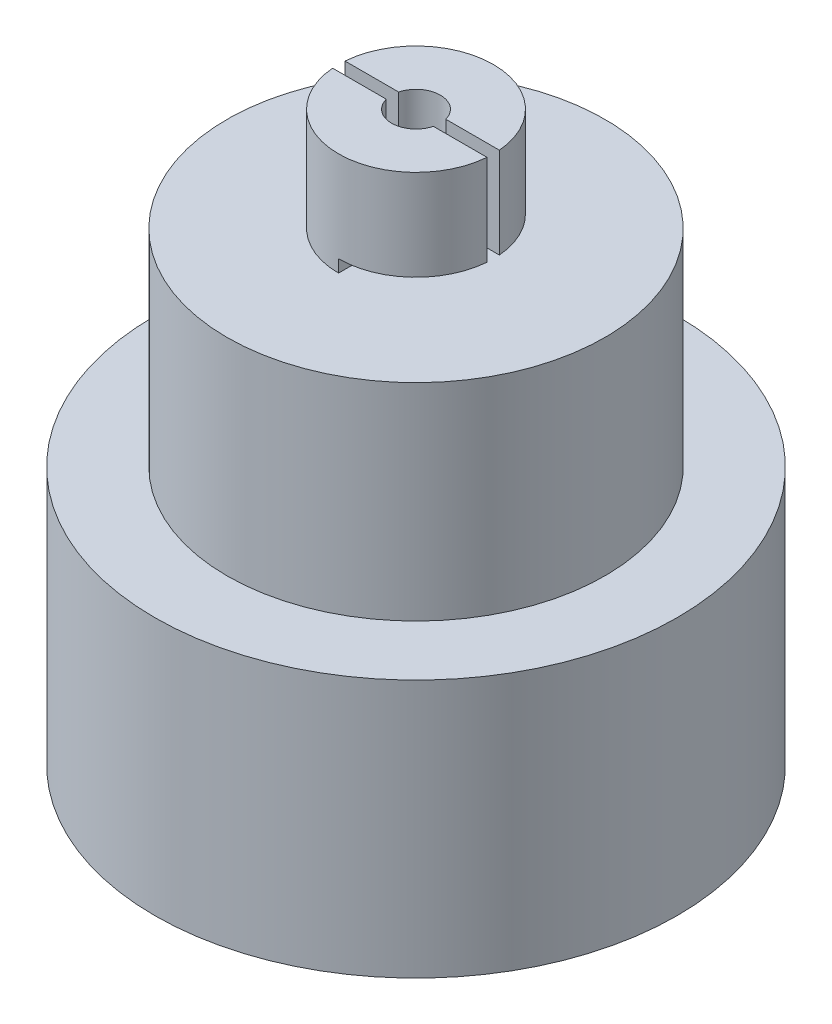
ISO-10303-21;
HEADER;
FILE_DESCRIPTION(('STEP AP214'),'2;1');
FILE_NAME('part.step','',(''),(''),'','','');
FILE_SCHEMA(('AUTOMOTIVE_DESIGN { 1 0 10303 214 1 1 1 1 }'));
ENDSEC;
DATA;
#1=APPLICATION_CONTEXT('core data for automotive mechanical design processes');
#2=APPLICATION_PROTOCOL_DEFINITION('international standard','automotive_design',2000,#1);
#3=PRODUCT_CONTEXT('',#1,'mechanical');
#4=PRODUCT('Part','Part','',(#3));
#5=PRODUCT_RELATED_PRODUCT_CATEGORY('part','',(#4));
#6=PRODUCT_DEFINITION_FORMATION('','',#4);
#7=PRODUCT_DEFINITION_CONTEXT('part definition',#1,'design');
#8=PRODUCT_DEFINITION('design','',#6,#7);
#9=PRODUCT_DEFINITION_SHAPE('','',#8);
#10=(LENGTH_UNIT() NAMED_UNIT(*) SI_UNIT(.MILLI.,.METRE.));
#11=(NAMED_UNIT(*) PLANE_ANGLE_UNIT() SI_UNIT($,.RADIAN.));
#12=(NAMED_UNIT(*) SI_UNIT($,.STERADIAN.) SOLID_ANGLE_UNIT());
#13=UNCERTAINTY_MEASURE_WITH_UNIT(LENGTH_MEASURE(1.E-05),#10,'distance_accuracy_value','');
#14=(GEOMETRIC_REPRESENTATION_CONTEXT(3) GLOBAL_UNCERTAINTY_ASSIGNED_CONTEXT((#13)) GLOBAL_UNIT_ASSIGNED_CONTEXT((#10,
#11,#12)) REPRESENTATION_CONTEXT('',''));
#15=CARTESIAN_POINT('',(0.,0.,0.));
#16=DIRECTION('',(0.,0.,1.));
#17=DIRECTION('',(1.,0.,0.));
#18=AXIS2_PLACEMENT_3D('',#15,#16,#17);
#19=CARTESIAN_POINT('',(0.,34.925,0.));
#20=DIRECTION('',(0.,-1.,0.));
#21=DIRECTION('',(0.,0.,-1.));
#22=AXIS2_PLACEMENT_3D('',#19,#20,#21);
#23=CYLINDRICAL_SURFACE('',#22,4.7625);
#24=DIRECTION('',(0.,-1.,0.));
#25=VECTOR('',#24,1.);
#26=CARTESIAN_POINT('',(0.,34.925,-4.7625));
#27=LINE('',#26,#25);
#28=CARTESIAN_POINT('',(0.,28.575,-4.7625));
#29=VERTEX_POINT('',#28);
#30=CARTESIAN_POINT('',(0.,29.337,-4.7625));
#31=VERTEX_POINT('',#30);
#32=EDGE_CURVE('E127',#29,#31,#27,.F.);
#33=ORIENTED_EDGE('',*,*,#32,.F.);
#34=CARTESIAN_POINT('',(0.,28.575,0.));
#35=DIRECTION('',(0.,1.,0.));
#36=DIRECTION('',(0.,0.,1.));
#37=AXIS2_PLACEMENT_3D('',#34,#35,#36);
#38=CIRCLE('',#37,4.7625);
#39=CARTESIAN_POINT('',(-4.74723553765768,28.575,-0.381));
#40=VERTEX_POINT('',#39);
#41=EDGE_CURVE('E137',#29,#40,#38,.T.);
#42=ORIENTED_EDGE('',*,*,#41,.T.);
#43=DIRECTION('',(0.,-1.,0.));
#44=VECTOR('',#43,1.);
#45=CARTESIAN_POINT('',(-4.74723553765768,34.925,-0.381));
#46=LINE('',#45,#44);
#47=CARTESIAN_POINT('',(-4.74723553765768,34.925,-0.381));
#48=VERTEX_POINT('',#47);
#49=EDGE_CURVE('E162',#48,#40,#46,.T.);
#50=ORIENTED_EDGE('',*,*,#49,.F.);
#51=CARTESIAN_POINT('',(0.,34.925,0.));
#52=DIRECTION('',(0.,1.,0.));
#53=DIRECTION('',(0.,0.,1.));
#54=AXIS2_PLACEMENT_3D('',#51,#52,#53);
#55=CIRCLE('',#54,4.7625);
#56=CARTESIAN_POINT('',(4.74723553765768,34.925,-0.381));
#57=VERTEX_POINT('',#56);
#58=EDGE_CURVE('E151',#57,#48,#55,.T.);
#59=ORIENTED_EDGE('',*,*,#58,.F.);
#60=DIRECTION('',(0.,-1.,0.));
#61=VECTOR('',#60,1.);
#62=CARTESIAN_POINT('',(4.74723553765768,34.925,-0.381));
#63=LINE('',#62,#61);
#64=CARTESIAN_POINT('',(4.74723553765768,29.337,-0.381));
#65=VERTEX_POINT('',#64);
#66=EDGE_CURVE('E160',#57,#65,#63,.T.);
#67=ORIENTED_EDGE('',*,*,#66,.T.);
#68=CARTESIAN_POINT('',(0.,29.337,0.));
#69=DIRECTION('',(0.,1.,0.));
#70=DIRECTION('',(0.,0.,1.));
#71=AXIS2_PLACEMENT_3D('',#68,#69,#70);
#72=CIRCLE('',#71,4.7625);
#73=EDGE_CURVE('E140',#65,#31,#72,.T.);
#74=ORIENTED_EDGE('',*,*,#73,.T.);
#75=EDGE_LOOP('',(#33,#42,#50,#59,#67,#74));
#76=FACE_BOUND('',#75,.T.);
#77=ADVANCED_FACE('F34',(#76),#23,.T.);
#78=CARTESIAN_POINT('',(0.,34.925,0.));
#79=DIRECTION('',(0.,-1.,0.));
#80=DIRECTION('',(0.,0.,-1.));
#81=AXIS2_PLACEMENT_3D('',#78,#79,#80);
#82=CYLINDRICAL_SURFACE('',#81,4.7625);
#83=DIRECTION('',(0.,-1.,0.));
#84=VECTOR('',#83,1.);
#85=CARTESIAN_POINT('',(0.,34.925,4.7625));
#86=LINE('',#85,#84);
#87=CARTESIAN_POINT('',(0.,29.337,4.7625));
#88=VERTEX_POINT('',#87);
#89=CARTESIAN_POINT('',(0.,28.575,4.7625));
#90=VERTEX_POINT('',#89);
#91=EDGE_CURVE('E142',#88,#90,#86,.T.);
#92=ORIENTED_EDGE('',*,*,#91,.F.);
#93=CARTESIAN_POINT('',(0.,29.337,0.));
#94=DIRECTION('',(0.,1.,0.));
#95=DIRECTION('',(0.,0.,1.));
#96=AXIS2_PLACEMENT_3D('',#93,#94,#95);
#97=CIRCLE('',#96,4.7625);
#98=CARTESIAN_POINT('',(4.74723553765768,29.337,0.381));
#99=VERTEX_POINT('',#98);
#100=EDGE_CURVE('E260',#88,#99,#97,.T.);
#101=ORIENTED_EDGE('',*,*,#100,.T.);
#102=DIRECTION('',(0.,-1.,0.));
#103=VECTOR('',#102,1.);
#104=CARTESIAN_POINT('',(4.74723553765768,34.925,0.381));
#105=LINE('',#104,#103);
#106=CARTESIAN_POINT('',(4.74723553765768,34.925,0.381));
#107=VERTEX_POINT('',#106);
#108=EDGE_CURVE('E149',#107,#99,#105,.T.);
#109=ORIENTED_EDGE('',*,*,#108,.F.);
#110=CARTESIAN_POINT('',(0.,34.925,0.));
#111=DIRECTION('',(0.,1.,0.));
#112=DIRECTION('',(0.,0.,1.));
#113=AXIS2_PLACEMENT_3D('',#110,#111,#112);
#114=CIRCLE('',#113,4.7625);
#115=CARTESIAN_POINT('',(-4.74723553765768,34.925,0.381));
#116=VERTEX_POINT('',#115);
#117=EDGE_CURVE('E200',#116,#107,#114,.T.);
#118=ORIENTED_EDGE('',*,*,#117,.F.);
#119=DIRECTION('',(0.,-1.,0.));
#120=VECTOR('',#119,1.);
#121=CARTESIAN_POINT('',(-4.74723553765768,34.925,0.381));
#122=LINE('',#121,#120);
#123=CARTESIAN_POINT('',(-4.74723553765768,28.575,0.381));
#124=VERTEX_POINT('',#123);
#125=EDGE_CURVE('E154',#116,#124,#122,.T.);
#126=ORIENTED_EDGE('',*,*,#125,.T.);
#127=CARTESIAN_POINT('',(0.,28.575,0.));
#128=DIRECTION('',(0.,1.,0.));
#129=DIRECTION('',(0.,0.,1.));
#130=AXIS2_PLACEMENT_3D('',#127,#128,#129);
#131=CIRCLE('',#130,4.7625);
#132=EDGE_CURVE('E194',#124,#90,#131,.T.);
#133=ORIENTED_EDGE('',*,*,#132,.T.);
#134=EDGE_LOOP('',(#92,#101,#109,#118,#126,#133));
#135=FACE_BOUND('',#134,.T.);
#136=ADVANCED_FACE('F244',(#135),#82,.T.);
#137=CARTESIAN_POINT('',(0.,28.575,0.));
#138=DIRECTION('',(0.,1.,0.));
#139=DIRECTION('',(0.,0.,1.));
#140=AXIS2_PLACEMENT_3D('',#137,#138,#139);
#141=CYLINDRICAL_SURFACE('',#140,1.4986);
#142=DIRECTION('',(0.,1.,0.));
#143=VECTOR('',#142,1.);
#144=CARTESIAN_POINT('',(0.,28.575,1.4986));
#145=LINE('',#144,#143);
#146=CARTESIAN_POINT('',(0.,28.575,1.4986));
#147=VERTEX_POINT('',#146);
#148=CARTESIAN_POINT('',(0.,29.337,1.4986));
#149=VERTEX_POINT('',#148);
#150=EDGE_CURVE('E262',#147,#149,#145,.T.);
#151=ORIENTED_EDGE('',*,*,#150,.F.);
#152=CARTESIAN_POINT('',(0.,28.575,0.));
#153=DIRECTION('',(0.,1.,0.));
#154=DIRECTION('',(0.,0.,1.));
#155=AXIS2_PLACEMENT_3D('',#152,#153,#154);
#156=CIRCLE('',#155,1.4986);
#157=CARTESIAN_POINT('',(-1.44935880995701,28.575,0.381));
#158=VERTEX_POINT('',#157);
#159=EDGE_CURVE('E222',#158,#147,#156,.T.);
#160=ORIENTED_EDGE('',*,*,#159,.F.);
#161=DIRECTION('',(0.,1.,0.));
#162=VECTOR('',#161,1.);
#163=CARTESIAN_POINT('',(-1.44935880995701,28.575,0.381));
#164=LINE('',#163,#162);
#165=CARTESIAN_POINT('',(-1.44935880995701,34.925,0.381));
#166=VERTEX_POINT('',#165);
#167=EDGE_CURVE('E196',#166,#158,#164,.F.);
#168=ORIENTED_EDGE('',*,*,#167,.F.);
#169=CARTESIAN_POINT('',(0.,34.925,0.));
#170=DIRECTION('',(0.,1.,0.));
#171=DIRECTION('',(0.,0.,1.));
#172=AXIS2_PLACEMENT_3D('',#169,#170,#171);
#173=CIRCLE('',#172,1.4986);
#174=CARTESIAN_POINT('',(1.44935880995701,34.925,0.381));
#175=VERTEX_POINT('',#174);
#176=EDGE_CURVE('E176',#166,#175,#173,.T.);
#177=ORIENTED_EDGE('',*,*,#176,.T.);
#178=DIRECTION('',(0.,1.,0.));
#179=VECTOR('',#178,1.);
#180=CARTESIAN_POINT('',(1.44935880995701,28.575,0.381));
#181=LINE('',#180,#179);
#182=CARTESIAN_POINT('',(1.44935880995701,29.337,0.381));
#183=VERTEX_POINT('',#182);
#184=EDGE_CURVE('E191',#183,#175,#181,.T.);
#185=ORIENTED_EDGE('',*,*,#184,.F.);
#186=CARTESIAN_POINT('',(0.,29.337,0.));
#187=DIRECTION('',(0.,1.,0.));
#188=DIRECTION('',(0.,0.,1.));
#189=AXIS2_PLACEMENT_3D('',#186,#187,#188);
#190=CIRCLE('',#189,1.4986);
#191=EDGE_CURVE('E254',#183,#149,#190,.F.);
#192=ORIENTED_EDGE('',*,*,#191,.T.);
#193=EDGE_LOOP('',(#151,#160,#168,#177,#185,#192));
#194=FACE_BOUND('',#193,.T.);
#195=ADVANCED_FACE('F252',(#194),#141,.F.);
#196=DIRECTION('',(0.,1.,0.));
#197=VECTOR('',#196,1.);
#198=CARTESIAN_POINT('',(0.,28.575,-1.4986));
#199=LINE('',#198,#197);
#200=CARTESIAN_POINT('',(0.,29.337,-1.4986));
#201=VERTEX_POINT('',#200);
#202=CARTESIAN_POINT('',(0.,28.575,-1.4986));
#203=VERTEX_POINT('',#202);
#204=EDGE_CURVE('E11',#201,#203,#199,.F.);
#205=ORIENTED_EDGE('',*,*,#204,.F.);
#206=CARTESIAN_POINT('',(0.,29.337,0.));
#207=DIRECTION('',(0.,1.,0.));
#208=DIRECTION('',(0.,0.,1.));
#209=AXIS2_PLACEMENT_3D('',#206,#207,#208);
#210=CIRCLE('',#209,1.4986);
#211=CARTESIAN_POINT('',(1.44935880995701,29.337,-0.381));
#212=VERTEX_POINT('',#211);
#213=EDGE_CURVE('E42',#201,#212,#210,.F.);
#214=ORIENTED_EDGE('',*,*,#213,.T.);
#215=DIRECTION('',(0.,1.,0.));
#216=VECTOR('',#215,1.);
#217=CARTESIAN_POINT('',(1.44935880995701,28.575,-0.381));
#218=LINE('',#217,#216);
#219=CARTESIAN_POINT('',(1.44935880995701,34.925,-0.381));
#220=VERTEX_POINT('',#219);
#221=EDGE_CURVE('E56',#220,#212,#218,.F.);
#222=ORIENTED_EDGE('',*,*,#221,.F.);
#223=CARTESIAN_POINT('',(0.,34.925,0.));
#224=DIRECTION('',(0.,1.,0.));
#225=DIRECTION('',(0.,0.,1.));
#226=AXIS2_PLACEMENT_3D('',#223,#224,#225);
#227=CIRCLE('',#226,1.4986);
#228=CARTESIAN_POINT('',(-1.44935880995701,34.925,-0.381));
#229=VERTEX_POINT('',#228);
#230=EDGE_CURVE('E217',#220,#229,#227,.T.);
#231=ORIENTED_EDGE('',*,*,#230,.T.);
#232=DIRECTION('',(0.,1.,0.));
#233=VECTOR('',#232,1.);
#234=CARTESIAN_POINT('',(-1.44935880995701,28.575,-0.381));
#235=LINE('',#234,#233);
#236=CARTESIAN_POINT('',(-1.44935880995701,28.575,-0.381));
#237=VERTEX_POINT('',#236);
#238=EDGE_CURVE('E190',#237,#229,#235,.T.);
#239=ORIENTED_EDGE('',*,*,#238,.F.);
#240=EDGE_CURVE('E221',#203,#237,#156,.T.);
#241=ORIENTED_EDGE('',*,*,#240,.F.);
#242=EDGE_LOOP('',(#205,#214,#222,#231,#239,#241));
#243=FACE_BOUND('',#242,.T.);
#244=ADVANCED_FACE('F181',(#243),#141,.F.);
#245=CARTESIAN_POINT('',(4.74723553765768,34.925,-0.381));
#246=DIRECTION('',(0.,0.,-1.));
#247=DIRECTION('',(-1.,0.,0.));
#248=AXIS2_PLACEMENT_3D('',#245,#246,#247);
#249=PLANE('',#248);
#250=DIRECTION('',(1.,0.,0.));
#251=VECTOR('',#250,1.);
#252=CARTESIAN_POINT('',(4.74723553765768,28.575,-0.381));
#253=LINE('',#252,#251);
#254=EDGE_CURVE('E148',#40,#237,#253,.T.);
#255=ORIENTED_EDGE('',*,*,#254,.T.);
#256=ORIENTED_EDGE('',*,*,#238,.T.);
#257=DIRECTION('',(1.,0.,0.));
#258=VECTOR('',#257,1.);
#259=CARTESIAN_POINT('',(4.74723553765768,34.925,-0.381));
#260=LINE('',#259,#258);
#261=EDGE_CURVE('E157',#48,#229,#260,.T.);
#262=ORIENTED_EDGE('',*,*,#261,.F.);
#263=ORIENTED_EDGE('',*,*,#49,.T.);
#264=EDGE_LOOP('',(#255,#256,#262,#263));
#265=FACE_BOUND('',#264,.T.);
#266=ADVANCED_FACE('F219',(#265),#249,.F.);
#267=CARTESIAN_POINT('',(4.74723553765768,34.925,0.381));
#268=DIRECTION('',(0.,0.,1.));
#269=DIRECTION('',(1.,0.,0.));
#270=AXIS2_PLACEMENT_3D('',#267,#268,#269);
#271=PLANE('',#270);
#272=ORIENTED_EDGE('',*,*,#108,.T.);
#273=DIRECTION('',(-1.,0.,0.));
#274=VECTOR('',#273,1.);
#275=CARTESIAN_POINT('',(4.74723553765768,29.337,0.381));
#276=LINE('',#275,#274);
#277=EDGE_CURVE('E258',#99,#183,#276,.T.);
#278=ORIENTED_EDGE('',*,*,#277,.T.);
#279=ORIENTED_EDGE('',*,*,#184,.T.);
#280=DIRECTION('',(-1.,0.,0.));
#281=VECTOR('',#280,1.);
#282=CARTESIAN_POINT('',(4.74723553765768,34.925,0.381));
#283=LINE('',#282,#281);
#284=EDGE_CURVE('E205',#107,#175,#283,.T.);
#285=ORIENTED_EDGE('',*,*,#284,.F.);
#286=EDGE_LOOP('',(#272,#278,#279,#285));
#287=FACE_BOUND('',#286,.T.);
#288=ADVANCED_FACE('F257',(#287),#271,.F.);
#289=CARTESIAN_POINT('',(0.,28.575,0.));
#290=DIRECTION('',(0.,1.,0.));
#291=DIRECTION('',(0.,0.,1.));
#292=AXIS2_PLACEMENT_3D('',#289,#290,#291);
#293=PLANE('',#292);
#294=DIRECTION('',(0.,0.,1.));
#295=VECTOR('',#294,1.);
#296=CARTESIAN_POINT('',(0.,28.575,-7.4811346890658));
#297=LINE('',#296,#295);
#298=EDGE_CURVE('E132',#147,#90,#297,.T.);
#299=ORIENTED_EDGE('',*,*,#298,.T.);
#300=ORIENTED_EDGE('',*,*,#132,.F.);
#301=DIRECTION('',(-1.,0.,0.));
#302=VECTOR('',#301,1.);
#303=CARTESIAN_POINT('',(4.74723553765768,28.575,0.381));
#304=LINE('',#303,#302);
#305=EDGE_CURVE('E204',#158,#124,#304,.T.);
#306=ORIENTED_EDGE('',*,*,#305,.F.);
#307=ORIENTED_EDGE('',*,*,#159,.T.);
#308=EDGE_LOOP('',(#299,#300,#306,#307));
#309=FACE_BOUND('',#308,.T.);
#310=EDGE_CURVE('E49',#29,#203,#297,.T.);
#311=ORIENTED_EDGE('',*,*,#310,.T.);
#312=ORIENTED_EDGE('',*,*,#240,.T.);
#313=ORIENTED_EDGE('',*,*,#254,.F.);
#314=ORIENTED_EDGE('',*,*,#41,.F.);
#315=EDGE_LOOP('',(#311,#312,#313,#314));
#316=FACE_BOUND('',#315,.T.);
#317=CARTESIAN_POINT('',(0.,28.575,0.));
#318=DIRECTION('',(0.,1.,0.));
#319=DIRECTION('',(0.,0.,1.));
#320=AXIS2_PLACEMENT_3D('',#317,#318,#319);
#321=CIRCLE('',#320,11.6205);
#322=CARTESIAN_POINT('',(0.,28.575,11.6205));
#323=VERTEX_POINT('',#322);
#324=EDGE_CURVE('E167',#323,#323,#321,.T.);
#325=ORIENTED_EDGE('',*,*,#324,.T.);
#326=EDGE_LOOP('',(#325));
#327=FACE_BOUND('',#326,.T.);
#328=ADVANCED_FACE('F145',(#309,#316,#327),#293,.T.);
#329=CARTESIAN_POINT('',(0.,15.875,0.));
#330=DIRECTION('',(0.,1.,0.));
#331=DIRECTION('',(0.,0.,1.));
#332=AXIS2_PLACEMENT_3D('',#329,#330,#331);
#333=PLANE('',#332);
#334=CARTESIAN_POINT('',(0.,15.875,0.));
#335=DIRECTION('',(0.,1.,0.));
#336=DIRECTION('',(0.,0.,1.));
#337=AXIS2_PLACEMENT_3D('',#334,#335,#336);
#338=CIRCLE('',#337,16.0655);
#339=CARTESIAN_POINT('',(0.,15.875,16.0655));
#340=VERTEX_POINT('',#339);
#341=EDGE_CURVE('E173',#340,#340,#338,.T.);
#342=ORIENTED_EDGE('',*,*,#341,.T.);
#343=EDGE_LOOP('',(#342));
#344=FACE_BOUND('',#343,.T.);
#345=CARTESIAN_POINT('',(0.,15.875,0.));
#346=DIRECTION('',(0.,1.,0.));
#347=DIRECTION('',(0.,0.,1.));
#348=AXIS2_PLACEMENT_3D('',#345,#346,#347);
#349=CIRCLE('',#348,11.6205);
#350=CARTESIAN_POINT('',(0.,15.875,11.6205));
#351=VERTEX_POINT('',#350);
#352=EDGE_CURVE('E164',#351,#351,#349,.T.);
#353=ORIENTED_EDGE('',*,*,#352,.F.);
#354=EDGE_LOOP('',(#353));
#355=FACE_BOUND('',#354,.T.);
#356=ADVANCED_FACE('F286',(#344,#355),#333,.T.);
#357=CARTESIAN_POINT('',(0.,15.875,0.));
#358=DIRECTION('',(0.,-1.,0.));
#359=DIRECTION('',(0.,0.,-1.));
#360=AXIS2_PLACEMENT_3D('',#357,#358,#359);
#361=CYLINDRICAL_SURFACE('',#360,16.0655);
#362=ORIENTED_EDGE('',*,*,#341,.F.);
#363=EDGE_LOOP('',(#362));
#364=FACE_BOUND('',#363,.T.);
#365=CARTESIAN_POINT('',(0.,0.,0.));
#366=DIRECTION('',(0.,1.,0.));
#367=DIRECTION('',(0.,0.,1.));
#368=AXIS2_PLACEMENT_3D('',#365,#366,#367);
#369=CIRCLE('',#368,16.0655);
#370=CARTESIAN_POINT('',(0.,0.,16.0655));
#371=VERTEX_POINT('',#370);
#372=EDGE_CURVE('E170',#371,#371,#369,.T.);
#373=ORIENTED_EDGE('',*,*,#372,.T.);
#374=EDGE_LOOP('',(#373));
#375=FACE_BOUND('',#374,.T.);
#376=ADVANCED_FACE('F36',(#364,#375),#361,.T.);
#377=CARTESIAN_POINT('',(0.,0.,0.));
#378=DIRECTION('',(0.,1.,0.));
#379=DIRECTION('',(0.,0.,1.));
#380=AXIS2_PLACEMENT_3D('',#377,#378,#379);
#381=PLANE('',#380);
#382=CARTESIAN_POINT('',(0.,0.,0.));
#383=DIRECTION('',(0.,-1.,0.));
#384=DIRECTION('',(0.,0.,-1.));
#385=AXIS2_PLACEMENT_3D('',#382,#383,#384);
#386=CIRCLE('',#385,12.446);
#387=CARTESIAN_POINT('',(0.,0.,-12.446));
#388=VERTEX_POINT('',#387);
#389=EDGE_CURVE('E228',#388,#388,#386,.T.);
#390=ORIENTED_EDGE('',*,*,#389,.F.);
#391=EDGE_LOOP('',(#390));
#392=FACE_BOUND('',#391,.T.);
#393=ORIENTED_EDGE('',*,*,#372,.F.);
#394=EDGE_LOOP('',(#393));
#395=FACE_BOUND('',#394,.T.);
#396=ADVANCED_FACE('F278',(#392,#395),#381,.F.);
#397=CARTESIAN_POINT('',(0.,28.575,0.));
#398=DIRECTION('',(0.,-1.,0.));
#399=DIRECTION('',(0.,0.,-1.));
#400=AXIS2_PLACEMENT_3D('',#397,#398,#399);
#401=CYLINDRICAL_SURFACE('',#400,11.6205);
#402=ORIENTED_EDGE('',*,*,#324,.F.);
#403=EDGE_LOOP('',(#402));
#404=FACE_BOUND('',#403,.T.);
#405=ORIENTED_EDGE('',*,*,#352,.T.);
#406=EDGE_LOOP('',(#405));
#407=FACE_BOUND('',#406,.T.);
#408=ADVANCED_FACE('F281',(#404,#407),#401,.T.);
#409=ORIENTED_EDGE('',*,*,#221,.T.);
#410=DIRECTION('',(1.,0.,0.));
#411=VECTOR('',#410,1.);
#412=CARTESIAN_POINT('',(4.74723553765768,29.337,-0.381));
#413=LINE('',#412,#411);
#414=EDGE_CURVE('E188',#212,#65,#413,.T.);
#415=ORIENTED_EDGE('',*,*,#414,.T.);
#416=ORIENTED_EDGE('',*,*,#66,.F.);
#417=EDGE_CURVE('E189',#220,#57,#260,.T.);
#418=ORIENTED_EDGE('',*,*,#417,.F.);
#419=EDGE_LOOP('',(#409,#415,#416,#418));
#420=FACE_BOUND('',#419,.T.);
#421=ADVANCED_FACE('F186',(#420),#249,.F.);
#422=CARTESIAN_POINT('',(0.,34.925,0.));
#423=DIRECTION('',(0.,1.,0.));
#424=DIRECTION('',(0.,0.,1.));
#425=AXIS2_PLACEMENT_3D('',#422,#423,#424);
#426=PLANE('',#425);
#427=ORIENTED_EDGE('',*,*,#230,.F.);
#428=ORIENTED_EDGE('',*,*,#417,.T.);
#429=ORIENTED_EDGE('',*,*,#58,.T.);
#430=ORIENTED_EDGE('',*,*,#261,.T.);
#431=EDGE_LOOP('',(#427,#428,#429,#430));
#432=FACE_BOUND('',#431,.T.);
#433=ADVANCED_FACE('F216',(#432),#426,.T.);
#434=EDGE_CURVE('E203',#166,#116,#283,.T.);
#435=ORIENTED_EDGE('',*,*,#434,.F.);
#436=ORIENTED_EDGE('',*,*,#167,.T.);
#437=ORIENTED_EDGE('',*,*,#305,.T.);
#438=ORIENTED_EDGE('',*,*,#125,.F.);
#439=EDGE_LOOP('',(#435,#436,#437,#438));
#440=FACE_BOUND('',#439,.T.);
#441=ADVANCED_FACE('F235',(#440),#271,.F.);
#442=CARTESIAN_POINT('',(0.,34.925,0.));
#443=DIRECTION('',(0.,1.,0.));
#444=DIRECTION('',(0.,0.,1.));
#445=AXIS2_PLACEMENT_3D('',#442,#443,#444);
#446=PLANE('',#445);
#447=ORIENTED_EDGE('',*,*,#176,.F.);
#448=ORIENTED_EDGE('',*,*,#434,.T.);
#449=ORIENTED_EDGE('',*,*,#117,.T.);
#450=ORIENTED_EDGE('',*,*,#284,.T.);
#451=EDGE_LOOP('',(#447,#448,#449,#450));
#452=FACE_BOUND('',#451,.T.);
#453=ADVANCED_FACE('F249',(#452),#446,.T.);
#454=CARTESIAN_POINT('',(0.,12.7,0.));
#455=DIRECTION('',(0.,-1.,0.));
#456=DIRECTION('',(0.,0.,-1.));
#457=AXIS2_PLACEMENT_3D('',#454,#455,#456);
#458=CYLINDRICAL_SURFACE('',#457,12.446);
#459=CARTESIAN_POINT('',(0.,12.7,0.));
#460=DIRECTION('',(0.,-1.,0.));
#461=DIRECTION('',(0.,0.,-1.));
#462=AXIS2_PLACEMENT_3D('',#459,#460,#461);
#463=CIRCLE('',#462,12.446);
#464=CARTESIAN_POINT('',(0.,12.7,-12.446));
#465=VERTEX_POINT('',#464);
#466=EDGE_CURVE('E223',#465,#465,#463,.T.);
#467=ORIENTED_EDGE('',*,*,#466,.F.);
#468=EDGE_LOOP('',(#467));
#469=FACE_BOUND('',#468,.T.);
#470=ORIENTED_EDGE('',*,*,#389,.T.);
#471=EDGE_LOOP('',(#470));
#472=FACE_BOUND('',#471,.T.);
#473=ADVANCED_FACE('F276',(#469,#472),#458,.F.);
#474=CARTESIAN_POINT('',(0.,12.7,0.));
#475=DIRECTION('',(0.,-1.,0.));
#476=DIRECTION('',(0.,0.,-1.));
#477=AXIS2_PLACEMENT_3D('',#474,#475,#476);
#478=PLANE('',#477);
#479=CARTESIAN_POINT('',(0.,12.7,0.));
#480=DIRECTION('',(0.,-1.,0.));
#481=DIRECTION('',(0.,0.,-1.));
#482=AXIS2_PLACEMENT_3D('',#479,#480,#481);
#483=CIRCLE('',#482,7.62);
#484=CARTESIAN_POINT('',(0.,12.7,-7.62));
#485=VERTEX_POINT('',#484);
#486=EDGE_CURVE('E141',#485,#485,#483,.T.);
#487=ORIENTED_EDGE('',*,*,#486,.F.);
#488=EDGE_LOOP('',(#487));
#489=FACE_BOUND('',#488,.T.);
#490=ORIENTED_EDGE('',*,*,#466,.T.);
#491=EDGE_LOOP('',(#490));
#492=FACE_BOUND('',#491,.T.);
#493=ADVANCED_FACE('F346',(#489,#492),#478,.T.);
#494=CARTESIAN_POINT('',(0.,25.4,0.));
#495=DIRECTION('',(0.,-1.,0.));
#496=DIRECTION('',(0.,0.,-1.));
#497=AXIS2_PLACEMENT_3D('',#494,#495,#496);
#498=CYLINDRICAL_SURFACE('',#497,7.62);
#499=CARTESIAN_POINT('',(0.,25.4,0.));
#500=DIRECTION('',(0.,-1.,0.));
#501=DIRECTION('',(0.,0.,-1.));
#502=AXIS2_PLACEMENT_3D('',#499,#500,#501);
#503=CIRCLE('',#502,7.62);
#504=CARTESIAN_POINT('',(0.,25.4,-7.62));
#505=VERTEX_POINT('',#504);
#506=EDGE_CURVE('E269',#505,#505,#503,.T.);
#507=ORIENTED_EDGE('',*,*,#506,.F.);
#508=EDGE_LOOP('',(#507));
#509=FACE_BOUND('',#508,.T.);
#510=ORIENTED_EDGE('',*,*,#486,.T.);
#511=EDGE_LOOP('',(#510));
#512=FACE_BOUND('',#511,.T.);
#513=ADVANCED_FACE('F353',(#509,#512),#498,.F.);
#514=CARTESIAN_POINT('',(0.,25.4,0.));
#515=DIRECTION('',(0.,-1.,0.));
#516=DIRECTION('',(0.,0.,-1.));
#517=AXIS2_PLACEMENT_3D('',#514,#515,#516);
#518=PLANE('',#517);
#519=CARTESIAN_POINT('',(0.,25.4,0.));
#520=DIRECTION('',(0.,-1.,0.));
#521=DIRECTION('',(0.,0.,-1.));
#522=AXIS2_PLACEMENT_3D('',#519,#520,#521);
#523=CIRCLE('',#522,1.83308710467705);
#524=CARTESIAN_POINT('',(0.,25.4,-1.83308710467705));
#525=VERTEX_POINT('',#524);
#526=EDGE_CURVE('E179',#525,#525,#523,.T.);
#527=ORIENTED_EDGE('',*,*,#526,.F.);
#528=EDGE_LOOP('',(#527));
#529=FACE_BOUND('',#528,.T.);
#530=ORIENTED_EDGE('',*,*,#506,.T.);
#531=EDGE_LOOP('',(#530));
#532=FACE_BOUND('',#531,.T.);
#533=ADVANCED_FACE('F360',(#529,#532),#518,.T.);
#534=CARTESIAN_POINT('',(0.,22.225,0.));
#535=DIRECTION('',(0.,1.,0.));
#536=DIRECTION('',(0.,0.,1.));
#537=AXIS2_PLACEMENT_3D('',#534,#535,#536);
#538=CONICAL_SURFACE('',#537,0.,0.523598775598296);
#539=ORIENTED_EDGE('',*,*,#526,.T.);
#540=EDGE_LOOP('',(#539));
#541=FACE_BOUND('',#540,.T.);
#542=CARTESIAN_POINT('',(0.,22.225,0.));
#543=VERTEX_POINT('',#542);
#544=VERTEX_LOOP('',#543);
#545=FACE_BOUND('',#544,.T.);
#546=ADVANCED_FACE('F368',(#541,#545),#538,.T.);
#547=CARTESIAN_POINT('',(0.,29.337,7.24438992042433));
#548=DIRECTION('',(0.,1.,0.));
#549=DIRECTION('',(0.,0.,1.));
#550=AXIS2_PLACEMENT_3D('',#547,#548,#549);
#551=PLANE('',#550);
#552=ORIENTED_EDGE('',*,*,#414,.F.);
#553=ORIENTED_EDGE('',*,*,#213,.F.);
#554=DIRECTION('',(0.,0.,1.));
#555=VECTOR('',#554,1.);
#556=CARTESIAN_POINT('',(0.,29.337,-7.4811346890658));
#557=LINE('',#556,#555);
#558=EDGE_CURVE('E498',#31,#201,#557,.T.);
#559=ORIENTED_EDGE('',*,*,#558,.F.);
#560=ORIENTED_EDGE('',*,*,#73,.F.);
#561=EDGE_LOOP('',(#552,#553,#559,#560));
#562=FACE_BOUND('',#561,.T.);
#563=ADVANCED_FACE('F376',(#562),#551,.F.);
#564=CARTESIAN_POINT('',(0.,29.337,-7.4811346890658));
#565=DIRECTION('',(1.,0.,0.));
#566=DIRECTION('',(0.,0.,-1.));
#567=AXIS2_PLACEMENT_3D('',#564,#565,#566);
#568=PLANE('',#567);
#569=ORIENTED_EDGE('',*,*,#32,.T.);
#570=ORIENTED_EDGE('',*,*,#558,.T.);
#571=ORIENTED_EDGE('',*,*,#204,.T.);
#572=ORIENTED_EDGE('',*,*,#310,.F.);
#573=EDGE_LOOP('',(#569,#570,#571,#572));
#574=FACE_BOUND('',#573,.T.);
#575=ADVANCED_FACE('F125',(#574),#568,.T.);
#576=ORIENTED_EDGE('',*,*,#91,.T.);
#577=ORIENTED_EDGE('',*,*,#298,.F.);
#578=ORIENTED_EDGE('',*,*,#150,.T.);
#579=EDGE_CURVE('E131',#149,#88,#557,.T.);
#580=ORIENTED_EDGE('',*,*,#579,.T.);
#581=EDGE_LOOP('',(#576,#577,#578,#580));
#582=FACE_BOUND('',#581,.T.);
#583=ADVANCED_FACE('F391',(#582),#568,.T.);
#584=ORIENTED_EDGE('',*,*,#579,.F.);
#585=ORIENTED_EDGE('',*,*,#191,.F.);
#586=ORIENTED_EDGE('',*,*,#277,.F.);
#587=ORIENTED_EDGE('',*,*,#100,.F.);
#588=EDGE_LOOP('',(#584,#585,#586,#587));
#589=FACE_BOUND('',#588,.T.);
#590=ADVANCED_FACE('F385',(#589),#551,.F.);
#591=CLOSED_SHELL('',(#77,#136,#195,#244,#266,#288,#328,#356,#376,#396,#408,#421,#433,#441,#453,
#473,#493,#513,#533,#546,#563,#575,#583,#590));
#592=MANIFOLD_SOLID_BREP('B2',#591);
#593=ADVANCED_BREP_SHAPE_REPRESENTATION('',(#18,#592),#14);
#594=SHAPE_DEFINITION_REPRESENTATION(#9,#593);
ENDSEC;
END-ISO-10303-21;
